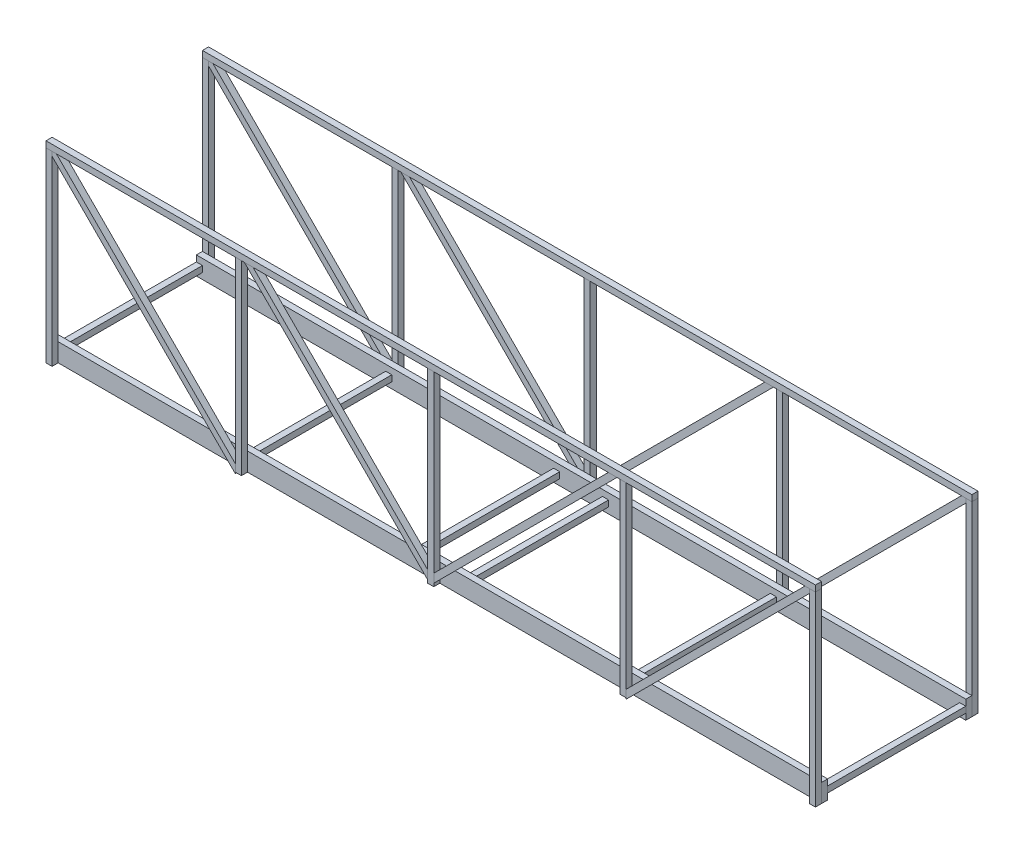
from build123d import *

# Parameters (mm, degrees)
SKETCH12_W                       = 3.175
SKETCH12_H                       = 9.525
STRUCTURAL_MEMBER1_DEPTH         = 400
SKETCH12_ON_SEGMENT_2_W          = 3.175
SKETCH12_ON_SEGMENT_2_H          = 9.525
STRUCTURAL_MEMBER1_2_DEPTH       = 400
SKETCH14_W                       = 3.175
SKETCH14_H                       = 3.175
STRUCTURAL_MEMBER2_DEPTH         = 75
SKETCH15_W                       = 3.175
SKETCH15_H                       = 3.175
STRUCTURAL_MEMBER3_DEPTH         = 75
SKETCH16_W                       = 3.175
SKETCH16_H                       = 3.175
STRUCTURAL_MEMBER4_DEPTH         = 75
SKETCH16_ON_SEGMENT_2_W          = 3.175
SKETCH16_ON_SEGMENT_2_H          = 3.175
STRUCTURAL_MEMBER4_2_DEPTH       = 75
SKETCH16_ON_SEGMENT_3_W          = 3.175
SKETCH16_ON_SEGMENT_3_H          = 3.175
STRUCTURAL_MEMBER4_3_DEPTH       = 75
SKETCH16_ON_SEGMENT_4_W          = 3.175
SKETCH16_ON_SEGMENT_4_H          = 3.175
STRUCTURAL_MEMBER4_4_DEPTH       = 75
SKETCH17_W                       = 3.175
SKETCH17_H                       = 3.175
STRUCTURAL_MEMBER5_DEPTH         = 100
SKETCH19_W                       = 3.175
SKETCH19_H                       = 3.175
STRUCTURAL_MEMBER6_DEPTH         = 100
SKETCH110_W                      = 3.175
SKETCH110_H                      = 3.175
STRUCTURAL_MEMBER7_DEPTH         = 100
SKETCH110_ON_SEGMENT_2_W         = 3.175
SKETCH110_ON_SEGMENT_2_H         = 3.175
STRUCTURAL_MEMBER7_2_DEPTH       = 100
SKETCH110_ON_SEGMENT_3_W         = 3.175
SKETCH110_ON_SEGMENT_3_H         = 3.175
STRUCTURAL_MEMBER7_3_DEPTH       = 100
SKETCH111_W                      = 3.175
SKETCH111_H                      = 3.175
STRUCTURAL_MEMBER8_DEPTH         = 400
SKETCH125_W                      = 3.175
SKETCH125_H                      = 3.175
STRUCTURAL_MEMBER15_DEPTH        = 100
SKETCH126_W                      = 3.175
SKETCH126_H                      = 3.175
STRUCTURAL_MEMBER16_DEPTH        = 100
SKETCH127_W                      = 3.175
SKETCH127_H                      = 3.175
STRUCTURAL_MEMBER17_DEPTH        = 100
SKETCH127_ON_SEGMENT_2_W         = 3.175
SKETCH127_ON_SEGMENT_2_H         = 3.175
STRUCTURAL_MEMBER17_2_DEPTH      = 100
SKETCH127_ON_SEGMENT_3_W         = 3.175
SKETCH127_ON_SEGMENT_3_H         = 3.175
STRUCTURAL_MEMBER17_3_DEPTH      = 100
SKETCH128_W                      = 3.175
SKETCH128_H                      = 3.175
STRUCTURAL_MEMBER18_DEPTH        = 400
SKETCH113_ON_SEGMENT_1_W         = 3.175
SKETCH113_ON_SEGMENT_1_H         = 3.175
STRUCTURAL_MEMBER9_DEPTH         = 142.421356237
SKETCH113_W                      = 3.175
SKETCH113_H                      = 3.175
STRUCTURAL_MEMBER9_2_DEPTH       = 141.421356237
BODY_START                       = 138.246356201
BODY_21_RUN_ON_DEPTH             = 76.130742
SKETCH130_ON_SEGMENT_1_W         = 3.175
SKETCH130_ON_SEGMENT_1_H         = 3.175
STRUCTURAL_MEMBER19_DEPTH        = 146.911484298
STRUCTURAL_MEMBER19_2_DEPTH      = 141.421356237
STRUCTURAL_MEMBER19_2_DEPTH_BACK = 5.490128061
SKETCH130_W                      = 3.175
SKETCH130_H                      = 3.175
SKETCH116_W                      = 3.175
SKETCH116_H                      = 3.175
STRUCTURAL_MEMBER10_DEPTH        = 141.421356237
BODY_25_RUN_ON_DEPTH             = 143.66642
SKETCH117_W                      = 3.175
SKETCH117_H                      = 3.175
STRUCTURAL_MEMBER11_DEPTH        = 141.421356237
SKETCH133_W                      = 3.175
SKETCH133_H                      = 3.175
STRUCTURAL_MEMBER21_DEPTH        = 141.421356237
BODY_27_RUN_ON_DEPTH             = 143.66642
SKETCH134_W                      = 3.175
SKETCH134_H                      = 3.175
STRUCTURAL_MEMBER22_DEPTH        = 141.421356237


with BuildPart() as part:
    # Sketch12 → Structural Member1 (new body)
    with BuildSketch(Plane(origin=(-200, 0, 37.5), x_dir=(0, 0, -1), z_dir=(1, 0, 0))):
        Rectangle(SKETCH12_W, SKETCH12_H)
    extrude(amount=STRUCTURAL_MEMBER1_DEPTH)


with BuildPart() as body_2:
    # Sketch12 on segment 2 (on carried to segment 2) → Structural Member1 2 (new body)
    with BuildSketch(Plane(origin=(-200, 0, -37.5), x_dir=(0, 0, -1), z_dir=(1, 0, 0))):
        Rectangle(SKETCH12_ON_SEGMENT_2_W, SKETCH12_ON_SEGMENT_2_H)
    extrude(amount=STRUCTURAL_MEMBER1_2_DEPTH)


with BuildPart() as body_3:
    # Sketch14 → Structural Member2 (new body)
    with BuildSketch(Plane(origin=(198.4125, 0, 37.5), x_dir=(-1, 0, 0), z_dir=(0, 0, -1))):
        Rectangle(SKETCH14_W, SKETCH14_H)
    extrude(amount=STRUCTURAL_MEMBER2_DEPTH)

    # Trim_Extend1 17: cut part
    add(part.part, mode=Mode.SUBTRACT)

    # Trim_Extend1 20
    split(bisect_by=Plane(origin=(0, 0, -35.9125), x_dir=(0, -1, 0), z_dir=(0, 0, 1)), keep=Keep.TOP)


with BuildPart() as body_4:
    # Sketch15 → Structural Member3 (new body)
    with BuildSketch(Plane(origin=(-198.4125, 0, 37.5), x_dir=(-1, 0, 0), z_dir=(0, 0, -1))):
        Rectangle(SKETCH15_W, SKETCH15_H)
    extrude(amount=STRUCTURAL_MEMBER3_DEPTH)

    # Trim_Extend1 17: cut part
    add(part.part, mode=Mode.SUBTRACT)

    # Trim_Extend1 34: cut body 2
    add(body_2.part, mode=Mode.SUBTRACT)


with BuildPart() as body_5:
    # Sketch16 → Structural Member4 (new body)
    with BuildSketch(Plane(origin=(-100, 0, -37.5), x_dir=(1, 0, 0), z_dir=(0, 0, 1))):
        Rectangle(SKETCH16_W, SKETCH16_H)
    extrude(amount=STRUCTURAL_MEMBER4_DEPTH)

    # Trim_Extend1
    split(bisect_by=Plane.YX.offset(-35.9125), keep=Keep.TOP)

    # Trim_Extend1 20
    split(bisect_by=Plane(origin=(0, 0, -35.9125), x_dir=(0, -1, 0), z_dir=(0, 0, 1)), keep=Keep.TOP)


with BuildPart() as body_6:
    # Sketch16 on segment 2 (on carried to segment 2) → Structural Member4 2 (new body)
    with BuildSketch(Plane(origin=(-12.7, 0, -37.5), x_dir=(1, 0, 0), z_dir=(0, 0, 1))):
        Rectangle(SKETCH16_ON_SEGMENT_2_W, SKETCH16_ON_SEGMENT_2_H)
    extrude(amount=STRUCTURAL_MEMBER4_2_DEPTH)

    # Trim_Extend1 17: cut part
    add(part.part, mode=Mode.SUBTRACT)

    # Trim_Extend1 34: cut body 2
    add(body_2.part, mode=Mode.SUBTRACT)


with BuildPart() as body_7:
    # Sketch16 on segment 3 (on carried to segment 3) → Structural Member4 3 (new body)
    with BuildSketch(Plane(origin=(12.7, 0, -37.5), x_dir=(1, 0, 0), z_dir=(0, 0, 1))):
        Rectangle(SKETCH16_ON_SEGMENT_3_W, SKETCH16_ON_SEGMENT_3_H)
    extrude(amount=STRUCTURAL_MEMBER4_3_DEPTH)

    # Trim_Extend1 17: cut part
    add(part.part, mode=Mode.SUBTRACT)

    # Trim_Extend1 34: cut body 2
    add(body_2.part, mode=Mode.SUBTRACT)


with BuildPart() as body_8:
    # Sketch16 on segment 4 (on carried to segment 4) → Structural Member4 4 (new body)
    with BuildSketch(Plane(origin=(100, 0, -37.5), x_dir=(1, 0, 0), z_dir=(0, 0, 1))):
        Rectangle(SKETCH16_ON_SEGMENT_4_W, SKETCH16_ON_SEGMENT_4_H)
    extrude(amount=STRUCTURAL_MEMBER4_4_DEPTH)

    # Trim_Extend1
    split(bisect_by=Plane.YX.offset(-35.9125), keep=Keep.TOP)

    # Trim_Extend1 20
    split(bisect_by=Plane(origin=(0, 0, -35.9125), x_dir=(0, -1, 0), z_dir=(0, 0, 1)), keep=Keep.TOP)


with BuildPart() as body_9:
    # Sketch17 → Structural Member5 (new body)
    with BuildSketch(Plane(origin=(-198.4125, -4.7625, 40.675), x_dir=(-1, 0, 0), z_dir=(0, 1, 0))):
        Rectangle(SKETCH17_W, SKETCH17_H)
    extrude(amount=STRUCTURAL_MEMBER5_DEPTH)


with BuildPart() as body_10:
    # Sketch19 → Structural Member6 (new body)
    with BuildSketch(Plane(origin=(198.4125, -4.7625, 40.675), x_dir=(-1, 0, 0), z_dir=(0, 1, 0))):
        Rectangle(SKETCH19_W, SKETCH19_H)
    extrude(amount=STRUCTURAL_MEMBER6_DEPTH)


with BuildPart() as body_11:
    # Sketch110 → Structural Member7 (new body)
    with BuildSketch(Plane(origin=(100, 95.2375, 40.675), x_dir=(1, 0, 0), z_dir=(0, -1, 0))):
        Rectangle(SKETCH110_W, SKETCH110_H)
    extrude(amount=STRUCTURAL_MEMBER7_DEPTH)

    # Trim_Extend2 7
    split(bisect_by=Plane(origin=(0, 92.0625, 40.675), x_dir=(1, 0, 0), z_dir=(0, -1, 0)), keep=Keep.TOP)


with BuildPart() as body_12:
    # Sketch110 on segment 2 (on carried to segment 2) → Structural Member7 2 (new body)
    with BuildSketch(Plane(origin=(0, 95.2375, 40.675), x_dir=(1, 0, 0), z_dir=(0, -1, 0))):
        Rectangle(SKETCH110_ON_SEGMENT_2_W, SKETCH110_ON_SEGMENT_2_H)
    extrude(amount=STRUCTURAL_MEMBER7_2_DEPTH)

    # Trim_Extend2 7
    split(bisect_by=Plane(origin=(0, 92.0625, 40.675), x_dir=(1, 0, 0), z_dir=(0, -1, 0)), keep=Keep.TOP)


with BuildPart() as body_13:
    # Sketch110 on segment 3 (on carried to segment 3) → Structural Member7 3 (new body)
    with BuildSketch(Plane(origin=(-100, 95.2375, 40.675), x_dir=(1, 0, 0), z_dir=(0, -1, 0))):
        Rectangle(SKETCH110_ON_SEGMENT_3_W, SKETCH110_ON_SEGMENT_3_H)
    extrude(amount=STRUCTURAL_MEMBER7_3_DEPTH)


with BuildPart() as body_14:
    # Sketch111 → Structural Member8 (new body)
    with BuildSketch(Plane(origin=(-200, 93.65, 40.675), x_dir=(0, 1, 0), z_dir=(1, 0, 0))):
        Rectangle(SKETCH111_W, SKETCH111_H)
    extrude(amount=STRUCTURAL_MEMBER8_DEPTH)


with BuildPart() as body_9_1:
    add(body_9.part)

    # Trim_Extend2 17: cut body 14
    add(body_14.part, mode=Mode.SUBTRACT)


with BuildPart() as body_13_1:
    add(body_13.part)

    # Trim_Extend2 17: cut body 14
    add(body_14.part, mode=Mode.SUBTRACT)


with BuildPart() as body_10_1:
    add(body_10.part)

    # Trim_Extend2 17: cut body 14
    add(body_14.part, mode=Mode.SUBTRACT)


with BuildPart() as body_15:
    # Sketch125 → Structural Member15 (new body)
    with BuildSketch(Plane(origin=(198.4125, -4.7625, -40.675), x_dir=(1, 0, 0), z_dir=(0, 1, 0))):
        Rectangle(SKETCH125_W, SKETCH125_H)
    extrude(amount=STRUCTURAL_MEMBER15_DEPTH)

    # Trim_Extend3 5
    split(bisect_by=Plane(origin=(0, 92.0625, -40.675), x_dir=(1, 0, 0), z_dir=(0, -1, 0)), keep=Keep.TOP)


with BuildPart() as body_16:
    # Sketch126 → Structural Member16 (new body)
    with BuildSketch(Plane(origin=(-198.4125, -4.7625, -40.675), x_dir=(1, 0, 0), z_dir=(0, 1, 0))):
        Rectangle(SKETCH126_W, SKETCH126_H)
    extrude(amount=STRUCTURAL_MEMBER16_DEPTH)


with BuildPart() as body_17:
    # Sketch127 → Structural Member17 (new body)
    with BuildSketch(Plane(origin=(100, -4.7625, -40.675), x_dir=(1, 0, 0), z_dir=(0, 1, 0))):
        Rectangle(SKETCH127_W, SKETCH127_H)
    extrude(amount=STRUCTURAL_MEMBER17_DEPTH)


with BuildPart() as body_18:
    # Sketch127 on segment 2 (on carried to segment 2) → Structural Member17 2 (new body)
    with BuildSketch(Plane(origin=(0, -4.7625, -40.675), x_dir=(1, 0, 0), z_dir=(0, 1, 0))):
        Rectangle(SKETCH127_ON_SEGMENT_2_W, SKETCH127_ON_SEGMENT_2_H)
    extrude(amount=STRUCTURAL_MEMBER17_2_DEPTH)

    # Trim_Extend3 5
    split(bisect_by=Plane(origin=(0, 92.0625, -40.675), x_dir=(1, 0, 0), z_dir=(0, -1, 0)), keep=Keep.TOP)


with BuildPart() as body_19:
    # Sketch127 on segment 3 (on carried to segment 3) → Structural Member17 3 (new body)
    with BuildSketch(Plane(origin=(-100, -4.7625, -40.675), x_dir=(1, 0, 0), z_dir=(0, 1, 0))):
        Rectangle(SKETCH127_ON_SEGMENT_3_W, SKETCH127_ON_SEGMENT_3_H)
    extrude(amount=STRUCTURAL_MEMBER17_3_DEPTH)

    # Trim_Extend3 5
    split(bisect_by=Plane(origin=(0, 92.0625, -40.675), x_dir=(1, 0, 0), z_dir=(0, -1, 0)), keep=Keep.TOP)


with BuildPart() as body_20:
    # Sketch128 → Structural Member18 (new body)
    with BuildSketch(Plane(origin=(-200, 93.65, -40.675), x_dir=(0, -1, 0), z_dir=(1, 0, 0))):
        Rectangle(SKETCH128_W, SKETCH128_H)
    extrude(amount=STRUCTURAL_MEMBER18_DEPTH)


with BuildPart() as body_17_1:
    add(body_17.part)

    # Trim_Extend3 17: cut body 20
    add(body_20.part, mode=Mode.SUBTRACT)


with BuildPart() as body_16_1:
    add(body_16.part)

    # Trim_Extend3 17: cut body 20
    add(body_20.part, mode=Mode.SUBTRACT)


with BuildPart() as body_21:
    # Sketch113 on segment 1 (on carried to segment 1) → Structural Member9 (new body)
    with BuildSketch(Plane(origin=(-98.877467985, 96.360032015, 40.675), x_dir=(0.707106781, 0.707106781, 0), z_dir=(0.707106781, -0.707106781, 0))):
        Rectangle(SKETCH113_ON_SEGMENT_1_W, SKETCH113_ON_SEGMENT_1_H)
    extrude(amount=STRUCTURAL_MEMBER9_DEPTH)

    # Structural Member9 end butt 1
    split(bisect_by=Plane(origin=(-2.24506403, -2.51743597, 39.0875), x_dir=(-0.707106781, -0.707106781, 0), z_dir=(-0.707106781, 0.707106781, 0)), keep=Keep.TOP)

    # Sketch113 on segment 1 (on carried to segment 1) → body 21 run on (add)
    with BuildSketch(Plane(origin=(-98.877467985, 96.360032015, 40.675), x_dir=(0.707106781, 0.707106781, 0), z_dir=(0.707106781, -0.707106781, 0)).offset(BODY_START)):
        Rectangle(SKETCH113_ON_SEGMENT_1_W, SKETCH113_ON_SEGMENT_1_H)
    extrude(amount=BODY_21_RUN_ON_DEPTH)

    # Trim_Extend6 7
    split(bisect_by=Plane(origin=(0, 92.0625, 40.675), x_dir=(1, 0, 0), z_dir=(0, -1, 0)), keep=Keep.TOP)

    # Trim_Extend6 24
    split(bisect_by=Plane(origin=(-1.5875, 43.65, 40.675), x_dir=(0, -1, 0), z_dir=(-1, 0, 0)), keep=Keep.TOP)


with BuildPart() as body_22:
    # Sketch113 → Structural Member9 2 (new body)
    with BuildSketch(Plane(origin=(-1.122532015, -3.639967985, 40.675), x_dir=(-0.707106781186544, 0.7071067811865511, 0), z_dir=(0.7071067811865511, 0.707106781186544, 0))):
        Rectangle(SKETCH113_W, SKETCH113_H)
    extrude(amount=STRUCTURAL_MEMBER9_2_DEPTH)

    # Trim_Extend6 7
    split(bisect_by=Plane(origin=(0, 92.0625, 40.675), x_dir=(1, 0, 0), z_dir=(0, -1, 0)), keep=Keep.TOP)

    # Trim_Extend6 22
    split(bisect_by=Plane(origin=(1.5875, 43.65, 40.675), x_dir=(0, 1, 0), z_dir=(1, 0, 0)), keep=Keep.TOP)


with BuildPart() as body_23:
    # Sketch130 on segment 1 (on carried to segment 1) → Structural Member19 (new body)
    with BuildSketch(Plane(origin=(-98.877467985, 96.360032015, -40.675), x_dir=(-0.707106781, -0.707106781, 0), z_dir=(0.707106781, -0.707106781, 0))):
        Rectangle(SKETCH130_ON_SEGMENT_1_W, SKETCH130_ON_SEGMENT_1_H)
    extrude(amount=STRUCTURAL_MEMBER19_DEPTH)

    # Structural Member19 mitre 1
    split(bisect_by=Plane(origin=(0, -4.7625, -39.0875), x_dir=(0, -1, 0), z_dir=(-1, 0, 0)), keep=Keep.TOP)

    # Trim_Extend17 5
    split(bisect_by=Plane(origin=(0, 92.0625, -40.675), x_dir=(1, 0, 0), z_dir=(0, -1, 0)), keep=Keep.TOP)

    # Trim_Extend17 24
    split(bisect_by=Plane(origin=(-1.5875, 43.65, -40.675), x_dir=(0, -1, 0), z_dir=(-1, 0, 0)), keep=Keep.TOP)


with BuildPart() as body_24:
    # Sketch130 → Structural Member19 2 (new, two sides: drawn at the far end of the back side and taken through both)
    with BuildSketch(Plane(origin=(-1.122532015, -3.639967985, -40.675), x_dir=(0.7071067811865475, -0.7071067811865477, 0), z_dir=(0.7071067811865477, 0.7071067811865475, 0)).offset(-STRUCTURAL_MEMBER19_2_DEPTH_BACK)):
        Rectangle(SKETCH130_W, SKETCH130_H)
    extrude(amount=STRUCTURAL_MEMBER19_2_DEPTH + STRUCTURAL_MEMBER19_2_DEPTH_BACK)

    # Structural Member19 2 mitre 1
    split(bisect_by=Plane(origin=(0, -4.7625, -39.0875), x_dir=(0, 1, 0), z_dir=(1, 0, 0)), keep=Keep.TOP)

    # Trim_Extend17 5
    split(bisect_by=Plane(origin=(0, 92.0625, -40.675), x_dir=(1, 0, 0), z_dir=(0, -1, 0)), keep=Keep.TOP)

    # Trim_Extend17 34: cut body 18
    add(body_18.part, mode=Mode.SUBTRACT)


with BuildPart() as body_25:
    # Sketch116 → Structural Member10 (new body)
    with BuildSketch(Plane(origin=(100, -4.7625, 40.675), x_dir=(-0.7071067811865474, 0.7071067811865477, 0), z_dir=(0.7071067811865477, 0.7071067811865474, 0))):
        Rectangle(SKETCH116_W, SKETCH116_H)
    extrude(amount=STRUCTURAL_MEMBER10_DEPTH)

    # Sketch116 → body 25 run on (add)
    with BuildSketch(Plane(origin=(100, -4.7625, 40.675), x_dir=(-0.7071067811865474, 0.7071067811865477, 0), z_dir=(0.7071067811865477, 0.7071067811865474, 0))):
        Rectangle(SKETCH116_W, SKETCH116_H)
    extrude(amount=-BODY_25_RUN_ON_DEPTH)

    # Trim_Extend8 5
    split(bisect_by=Plane(origin=(101.5875, 43.65, 40.675), x_dir=(0, 1, 0), z_dir=(1, 0, 0)), keep=Keep.TOP)

    # Trim_Extend8 24
    split(bisect_by=Plane(origin=(0, 92.0625, 40.675), x_dir=(1, 0, 0), z_dir=(0, -1, 0)), keep=Keep.TOP)

    # Trim_Extend8 39
    split(bisect_by=Plane(origin=(196.825, 43.65, 40.675), x_dir=(0, -1, 0), z_dir=(-1, 0, 0)), keep=Keep.TOP)


with BuildPart() as body_26:
    # Sketch117 → Structural Member11 (new body)
    with BuildSketch(Plane(origin=(-200, 95.2375, 40.675), x_dir=(0.7071067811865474, 0.7071067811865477, 0), z_dir=(0.7071067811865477, -0.7071067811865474, 0))):
        Rectangle(SKETCH117_W, SKETCH117_H)
    extrude(amount=STRUCTURAL_MEMBER11_DEPTH)

    # Trim_Extend16 7
    split(bisect_by=Plane(origin=(-101.5875, 43.65, 40.675), x_dir=(0, -1, 0), z_dir=(-1, 0, 0)), keep=Keep.TOP)

    # Trim_Extend15 7
    split(bisect_by=Plane(origin=(0, 92.0625, 40.675), x_dir=(1, 0, 0), z_dir=(0, -1, 0)), keep=Keep.TOP)

    # Trim_Extend15 34: cut body 9
    add(body_9_1.part, mode=Mode.SUBTRACT)


with BuildPart() as body_27:
    # Sketch133 → Structural Member21 (new body)
    with BuildSketch(Plane(origin=(-100, -4.7625, -40.675), x_dir=(0.7071067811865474, 0.7071067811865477, 0), z_dir=(-0.7071067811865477, 0.7071067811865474, 0))):
        Rectangle(SKETCH133_W, SKETCH133_H)
    extrude(amount=STRUCTURAL_MEMBER21_DEPTH)

    # Sketch133 → body 27 run on (add)
    with BuildSketch(Plane(origin=(-100, -4.7625, -40.675), x_dir=(0.7071067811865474, 0.7071067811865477, 0), z_dir=(-0.7071067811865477, 0.7071067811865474, 0))):
        Rectangle(SKETCH133_W, SKETCH133_H)
    extrude(amount=-BODY_27_RUN_ON_DEPTH)

    # Trim_Extend13 7
    split(bisect_by=Plane(origin=(-101.5875, 43.65, -40.675), x_dir=(0, -1, 0), z_dir=(-1, 0, 0)), keep=Keep.TOP)

    # Trim_Extend13 22
    split(bisect_by=Plane(origin=(0, 92.0625, -40.675), x_dir=(1, 0, 0), z_dir=(0, -1, 0)), keep=Keep.TOP)

    # Trim_Extend13 39
    split(bisect_by=Plane(origin=(-196.825, 43.65, -40.675), x_dir=(0, 1, 0), z_dir=(1, 0, 0)), keep=Keep.TOP)


with BuildPart() as body_28:
    # Sketch134 → Structural Member22 (new body)
    with BuildSketch(Plane(origin=(100, -4.7625, -40.675), x_dir=(0.7071067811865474, -0.7071067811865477, 0), z_dir=(0.7071067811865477, 0.7071067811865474, 0))):
        Rectangle(SKETCH134_W, SKETCH134_H)
    extrude(amount=STRUCTURAL_MEMBER22_DEPTH)

    # Trim_Extend14 7
    split(bisect_by=Plane(origin=(196.825, 43.65, -40.675), x_dir=(0, -1, 0), z_dir=(-1, 0, 0)), keep=Keep.TOP)

    # Trim_Extend14 34: cut body 20
    add(body_20.part, mode=Mode.SUBTRACT)

    # Trim_Extend14 39
    split(bisect_by=Plane(origin=(101.5875, 43.65, -40.675), x_dir=(0, 1, 0), z_dir=(1, 0, 0)), keep=Keep.TOP)


solid = Compound([part.part, body_2.part, body_3.part, body_4.part, body_5.part, body_6.part, body_7.part, body_8.part, body_11.part, body_12.part, body_14.part, body_9_1.part, body_13_1.part, body_10_1.part, body_15.part, body_18.part, body_19.part, body_20.part, body_17_1.part, body_16_1.part, body_21.part, body_22.part, body_23.part, body_24.part, body_25.part, body_26.part, body_27.part, body_28.part])
